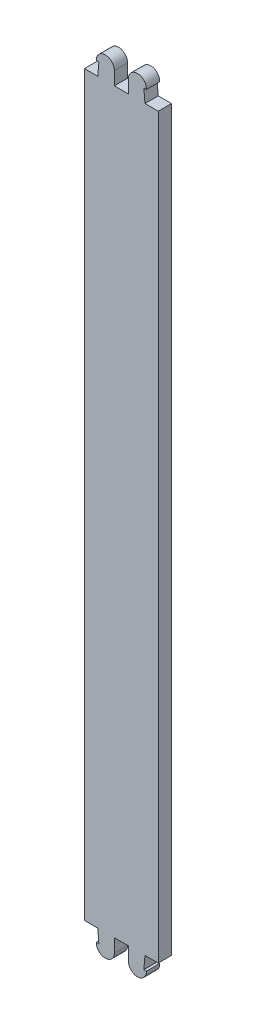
ISO-10303-21;
HEADER;
FILE_DESCRIPTION(('STEP AP214'),'2;1');
FILE_NAME('part.step','',(''),(''),'','','');
FILE_SCHEMA(('AUTOMOTIVE_DESIGN { 1 0 10303 214 1 1 1 1 }'));
ENDSEC;
DATA;
#1=APPLICATION_CONTEXT('core data for automotive mechanical design processes');
#2=APPLICATION_PROTOCOL_DEFINITION('international standard','automotive_design',2000,#1);
#3=PRODUCT_CONTEXT('',#1,'mechanical');
#4=PRODUCT('Part','Part','',(#3));
#5=PRODUCT_RELATED_PRODUCT_CATEGORY('part','',(#4));
#6=PRODUCT_DEFINITION_FORMATION('','',#4);
#7=PRODUCT_DEFINITION_CONTEXT('part definition',#1,'design');
#8=PRODUCT_DEFINITION('design','',#6,#7);
#9=PRODUCT_DEFINITION_SHAPE('','',#8);
#10=(LENGTH_UNIT() NAMED_UNIT(*) SI_UNIT(.MILLI.,.METRE.));
#11=(NAMED_UNIT(*) PLANE_ANGLE_UNIT() SI_UNIT($,.RADIAN.));
#12=(NAMED_UNIT(*) SI_UNIT($,.STERADIAN.) SOLID_ANGLE_UNIT());
#13=UNCERTAINTY_MEASURE_WITH_UNIT(LENGTH_MEASURE(1.E-05),#10,'distance_accuracy_value','');
#14=(GEOMETRIC_REPRESENTATION_CONTEXT(3) GLOBAL_UNCERTAINTY_ASSIGNED_CONTEXT((#13)) GLOBAL_UNIT_ASSIGNED_CONTEXT((#10,
#11,#12)) REPRESENTATION_CONTEXT('',''));
#15=CARTESIAN_POINT('',(0.,0.,0.));
#16=DIRECTION('',(0.,0.,1.));
#17=DIRECTION('',(1.,0.,0.));
#18=AXIS2_PLACEMENT_3D('',#15,#16,#17);
#19=CARTESIAN_POINT('',(3.26487,-115.2,2.7));
#20=DIRECTION('',(0.,0.,-1.));
#21=DIRECTION('',(-1.,0.,0.));
#22=AXIS2_PLACEMENT_3D('',#19,#20,#21);
#23=CYLINDRICAL_SURFACE('',#22,1.83487);
#24=CARTESIAN_POINT('',(3.26487,-115.2,0.));
#25=DIRECTION('',(0.,0.,1.));
#26=DIRECTION('',(1.,0.,0.));
#27=AXIS2_PLACEMENT_3D('',#24,#25,#26);
#28=CIRCLE('',#27,1.83487);
#29=CARTESIAN_POINT('',(5.09840426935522,-115.13,0.));
#30=VERTEX_POINT('',#29);
#31=CARTESIAN_POINT('',(1.43,-115.2,0.));
#32=VERTEX_POINT('',#31);
#33=EDGE_CURVE('E240',#30,#32,#28,.F.);
#34=ORIENTED_EDGE('',*,*,#33,.F.);
#35=DIRECTION('',(0.,0.,-1.));
#36=VECTOR('',#35,1.);
#37=CARTESIAN_POINT('',(5.09840426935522,-115.13,2.7));
#38=LINE('',#37,#36);
#39=CARTESIAN_POINT('',(5.09840426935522,-115.13,2.7));
#40=VERTEX_POINT('',#39);
#41=EDGE_CURVE('E11',#40,#30,#38,.T.);
#42=ORIENTED_EDGE('',*,*,#41,.F.);
#43=CARTESIAN_POINT('',(3.26487,-115.2,2.7));
#44=DIRECTION('',(0.,0.,1.));
#45=DIRECTION('',(1.,0.,0.));
#46=AXIS2_PLACEMENT_3D('',#43,#44,#45);
#47=CIRCLE('',#46,1.83487);
#48=CARTESIAN_POINT('',(1.43,-115.2,2.7));
#49=VERTEX_POINT('',#48);
#50=EDGE_CURVE('E325',#40,#49,#47,.F.);
#51=ORIENTED_EDGE('',*,*,#50,.T.);
#52=DIRECTION('',(0.,0.,-1.));
#53=VECTOR('',#52,1.);
#54=CARTESIAN_POINT('',(1.43,-115.2,2.7));
#55=LINE('',#54,#53);
#56=EDGE_CURVE('E146',#49,#32,#55,.T.);
#57=ORIENTED_EDGE('',*,*,#56,.T.);
#58=EDGE_LOOP('',(#34,#42,#51,#57));
#59=FACE_BOUND('',#58,.T.);
#60=ADVANCED_FACE('F47',(#59),#23,.T.);
#61=CARTESIAN_POINT('',(0.,-115.13,2.7));
#62=DIRECTION('',(0.,1.,0.));
#63=DIRECTION('',(0.,0.,1.));
#64=AXIS2_PLACEMENT_3D('',#61,#62,#63);
#65=PLANE('',#64);
#66=DIRECTION('',(1.,0.,0.));
#67=VECTOR('',#66,1.);
#68=CARTESIAN_POINT('',(0.,-115.13,0.));
#69=LINE('',#68,#67);
#70=CARTESIAN_POINT('',(4.57,-115.13,0.));
#71=VERTEX_POINT('',#70);
#72=EDGE_CURVE('E244',#71,#30,#69,.T.);
#73=ORIENTED_EDGE('',*,*,#72,.F.);
#74=DIRECTION('',(0.,0.,-1.));
#75=VECTOR('',#74,1.);
#76=CARTESIAN_POINT('',(4.57,-115.13,2.7));
#77=LINE('',#76,#75);
#78=CARTESIAN_POINT('',(4.57,-115.13,2.7));
#79=VERTEX_POINT('',#78);
#80=EDGE_CURVE('E56',#79,#71,#77,.T.);
#81=ORIENTED_EDGE('',*,*,#80,.F.);
#82=DIRECTION('',(1.,0.,0.));
#83=VECTOR('',#82,1.);
#84=CARTESIAN_POINT('',(0.,-115.13,2.7));
#85=LINE('',#84,#83);
#86=EDGE_CURVE('E415',#79,#40,#85,.T.);
#87=ORIENTED_EDGE('',*,*,#86,.T.);
#88=ORIENTED_EDGE('',*,*,#41,.T.);
#89=EDGE_LOOP('',(#73,#81,#87,#88));
#90=FACE_BOUND('',#89,.T.);
#91=ADVANCED_FACE('F403',(#90),#65,.T.);
#92=CARTESIAN_POINT('',(14.5313430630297,-1.27132778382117,2.7));
#93=DIRECTION('',(0.996194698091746,-0.0871557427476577,0.));
#94=DIRECTION('',(0.0871557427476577,0.996194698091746,0.));
#95=AXIS2_PLACEMENT_3D('',#92,#93,#94);
#96=PLANE('',#95);
#97=DIRECTION('',(-0.0871557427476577,-0.996194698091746,0.));
#98=VECTOR('',#97,1.);
#99=CARTESIAN_POINT('',(14.5313430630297,-1.27132778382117,0.));
#100=LINE('',#99,#98);
#101=CARTESIAN_POINT('',(4.80009518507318,-112.5,0.));
#102=VERTEX_POINT('',#101);
#103=EDGE_CURVE('E248',#102,#71,#100,.T.);
#104=ORIENTED_EDGE('',*,*,#103,.F.);
#105=DIRECTION('',(0.,0.,-1.));
#106=VECTOR('',#105,1.);
#107=CARTESIAN_POINT('',(4.80009518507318,-112.5,2.7));
#108=LINE('',#107,#106);
#109=CARTESIAN_POINT('',(4.80009518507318,-112.5,2.7));
#110=VERTEX_POINT('',#109);
#111=EDGE_CURVE('E390',#110,#102,#108,.T.);
#112=ORIENTED_EDGE('',*,*,#111,.F.);
#113=DIRECTION('',(-0.0871557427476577,-0.996194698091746,0.));
#114=VECTOR('',#113,1.);
#115=CARTESIAN_POINT('',(14.5313430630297,-1.27132778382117,2.7));
#116=LINE('',#115,#114);
#117=EDGE_CURVE('E399',#110,#79,#116,.T.);
#118=ORIENTED_EDGE('',*,*,#117,.T.);
#119=ORIENTED_EDGE('',*,*,#80,.T.);
#120=EDGE_LOOP('',(#104,#112,#118,#119));
#121=FACE_BOUND('',#120,.T.);
#122=ADVANCED_FACE('F397',(#121),#96,.T.);
#123=CARTESIAN_POINT('',(0.,-112.5,2.7));
#124=DIRECTION('',(0.,-1.,0.));
#125=DIRECTION('',(0.,0.,-1.));
#126=AXIS2_PLACEMENT_3D('',#123,#124,#125);
#127=PLANE('',#126);
#128=DIRECTION('',(-1.,0.,0.));
#129=VECTOR('',#128,1.);
#130=CARTESIAN_POINT('',(0.,-112.5,0.));
#131=LINE('',#130,#129);
#132=CARTESIAN_POINT('',(7.50526,-112.5,0.));
#133=VERTEX_POINT('',#132);
#134=EDGE_CURVE('E252',#133,#102,#131,.T.);
#135=ORIENTED_EDGE('',*,*,#134,.F.);
#136=DIRECTION('',(0.,0.,-1.));
#137=VECTOR('',#136,1.);
#138=CARTESIAN_POINT('',(7.50526,-112.5,2.7));
#139=LINE('',#138,#137);
#140=CARTESIAN_POINT('',(7.50526,-112.5,2.7));
#141=VERTEX_POINT('',#140);
#142=EDGE_CURVE('E387',#141,#133,#139,.T.);
#143=ORIENTED_EDGE('',*,*,#142,.F.);
#144=DIRECTION('',(-1.,0.,0.));
#145=VECTOR('',#144,1.);
#146=CARTESIAN_POINT('',(0.,-112.5,2.7));
#147=LINE('',#146,#145);
#148=EDGE_CURVE('E414',#141,#110,#147,.T.);
#149=ORIENTED_EDGE('',*,*,#148,.T.);
#150=ORIENTED_EDGE('',*,*,#111,.T.);
#151=EDGE_LOOP('',(#135,#143,#149,#150));
#152=FACE_BOUND('',#151,.T.);
#153=ADVANCED_FACE('F410',(#152),#127,.T.);
#154=CARTESIAN_POINT('',(7.50526,0.,2.7));
#155=DIRECTION('',(-1.,0.,0.));
#156=DIRECTION('',(0.,0.,1.));
#157=AXIS2_PLACEMENT_3D('',#154,#155,#156);
#158=PLANE('',#157);
#159=DIRECTION('',(0.,1.,0.));
#160=VECTOR('',#159,1.);
#161=CARTESIAN_POINT('',(7.50526,0.,0.));
#162=LINE('',#161,#160);
#163=CARTESIAN_POINT('',(7.50526,37.5,0.));
#164=VERTEX_POINT('',#163);
#165=EDGE_CURVE('E256',#133,#164,#162,.T.);
#166=ORIENTED_EDGE('',*,*,#165,.T.);
#167=DIRECTION('',(0.,0.,-1.));
#168=VECTOR('',#167,1.);
#169=CARTESIAN_POINT('',(7.50526,37.5,2.7));
#170=LINE('',#169,#168);
#171=CARTESIAN_POINT('',(7.50526,37.5,2.7));
#172=VERTEX_POINT('',#171);
#173=EDGE_CURVE('E383',#172,#164,#170,.T.);
#174=ORIENTED_EDGE('',*,*,#173,.F.);
#175=DIRECTION('',(0.,1.,0.));
#176=VECTOR('',#175,1.);
#177=CARTESIAN_POINT('',(7.50526,0.,2.7));
#178=LINE('',#177,#176);
#179=EDGE_CURVE('E420',#141,#172,#178,.T.);
#180=ORIENTED_EDGE('',*,*,#179,.F.);
#181=ORIENTED_EDGE('',*,*,#142,.T.);
#182=EDGE_LOOP('',(#166,#174,#180,#181));
#183=FACE_BOUND('',#182,.T.);
#184=ADVANCED_FACE('F502',(#183),#158,.F.);
#185=CARTESIAN_POINT('',(0.,37.5,2.7));
#186=DIRECTION('',(0.,-1.,0.));
#187=DIRECTION('',(0.,0.,-1.));
#188=AXIS2_PLACEMENT_3D('',#185,#186,#187);
#189=PLANE('',#188);
#190=DIRECTION('',(-1.,0.,0.));
#191=VECTOR('',#190,1.);
#192=CARTESIAN_POINT('',(0.,37.5,0.));
#193=LINE('',#192,#191);
#194=CARTESIAN_POINT('',(4.80009518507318,37.5,0.));
#195=VERTEX_POINT('',#194);
#196=EDGE_CURVE('E259',#164,#195,#193,.T.);
#197=ORIENTED_EDGE('',*,*,#196,.T.);
#198=DIRECTION('',(0.,0.,-1.));
#199=VECTOR('',#198,1.);
#200=CARTESIAN_POINT('',(4.80009518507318,37.5,2.7));
#201=LINE('',#200,#199);
#202=CARTESIAN_POINT('',(4.80009518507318,37.5,2.7));
#203=VERTEX_POINT('',#202);
#204=EDGE_CURVE('E379',#203,#195,#201,.T.);
#205=ORIENTED_EDGE('',*,*,#204,.F.);
#206=DIRECTION('',(-1.,0.,0.));
#207=VECTOR('',#206,1.);
#208=CARTESIAN_POINT('',(0.,37.5,2.7));
#209=LINE('',#208,#207);
#210=EDGE_CURVE('E427',#172,#203,#209,.T.);
#211=ORIENTED_EDGE('',*,*,#210,.F.);
#212=ORIENTED_EDGE('',*,*,#173,.T.);
#213=EDGE_LOOP('',(#197,#205,#211,#212));
#214=FACE_BOUND('',#213,.T.);
#215=ADVANCED_FACE('F505',(#214),#189,.F.);
#216=CARTESIAN_POINT('',(8.01953640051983,0.701618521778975,2.7));
#217=DIRECTION('',(-0.996194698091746,-0.0871557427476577,0.));
#218=DIRECTION('',(0.0871557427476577,-0.996194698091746,0.));
#219=AXIS2_PLACEMENT_3D('',#216,#217,#218);
#220=PLANE('',#219);
#221=DIRECTION('',(-0.0871557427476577,0.996194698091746,0.));
#222=VECTOR('',#221,1.);
#223=CARTESIAN_POINT('',(8.01953640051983,0.701618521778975,0.));
#224=LINE('',#223,#222);
#225=CARTESIAN_POINT('',(4.57,40.13,0.));
#226=VERTEX_POINT('',#225);
#227=EDGE_CURVE('E262',#195,#226,#224,.T.);
#228=ORIENTED_EDGE('',*,*,#227,.T.);
#229=DIRECTION('',(0.,0.,-1.));
#230=VECTOR('',#229,1.);
#231=CARTESIAN_POINT('',(4.57,40.13,2.7));
#232=LINE('',#231,#230);
#233=CARTESIAN_POINT('',(4.57,40.13,2.7));
#234=VERTEX_POINT('',#233);
#235=EDGE_CURVE('E375',#234,#226,#232,.T.);
#236=ORIENTED_EDGE('',*,*,#235,.F.);
#237=DIRECTION('',(-0.0871557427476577,0.996194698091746,0.));
#238=VECTOR('',#237,1.);
#239=CARTESIAN_POINT('',(8.01953640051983,0.701618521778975,2.7));
#240=LINE('',#239,#238);
#241=EDGE_CURVE('E430',#203,#234,#240,.T.);
#242=ORIENTED_EDGE('',*,*,#241,.F.);
#243=ORIENTED_EDGE('',*,*,#204,.T.);
#244=EDGE_LOOP('',(#228,#236,#242,#243));
#245=FACE_BOUND('',#244,.T.);
#246=ADVANCED_FACE('F509',(#245),#220,.F.);
#247=CARTESIAN_POINT('',(0.,40.13,2.7));
#248=DIRECTION('',(0.,1.,0.));
#249=DIRECTION('',(0.,0.,1.));
#250=AXIS2_PLACEMENT_3D('',#247,#248,#249);
#251=PLANE('',#250);
#252=DIRECTION('',(1.,0.,0.));
#253=VECTOR('',#252,1.);
#254=CARTESIAN_POINT('',(0.,40.13,0.));
#255=LINE('',#254,#253);
#256=CARTESIAN_POINT('',(5.09840426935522,40.13,0.));
#257=VERTEX_POINT('',#256);
#258=EDGE_CURVE('E265',#226,#257,#255,.T.);
#259=ORIENTED_EDGE('',*,*,#258,.T.);
#260=DIRECTION('',(0.,0.,-1.));
#261=VECTOR('',#260,1.);
#262=CARTESIAN_POINT('',(5.09840426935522,40.13,2.7));
#263=LINE('',#262,#261);
#264=CARTESIAN_POINT('',(5.09840426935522,40.13,2.7));
#265=VERTEX_POINT('',#264);
#266=EDGE_CURVE('E371',#265,#257,#263,.T.);
#267=ORIENTED_EDGE('',*,*,#266,.F.);
#268=DIRECTION('',(1.,0.,0.));
#269=VECTOR('',#268,1.);
#270=CARTESIAN_POINT('',(0.,40.13,2.7));
#271=LINE('',#270,#269);
#272=EDGE_CURVE('E433',#234,#265,#271,.T.);
#273=ORIENTED_EDGE('',*,*,#272,.F.);
#274=ORIENTED_EDGE('',*,*,#235,.T.);
#275=EDGE_LOOP('',(#259,#267,#273,#274));
#276=FACE_BOUND('',#275,.T.);
#277=ADVANCED_FACE('F513',(#276),#251,.F.);
#278=CARTESIAN_POINT('',(3.26487,40.2,2.7));
#279=DIRECTION('',(0.,0.,-1.));
#280=DIRECTION('',(-1.,0.,0.));
#281=AXIS2_PLACEMENT_3D('',#278,#279,#280);
#282=CYLINDRICAL_SURFACE('',#281,1.83487);
#283=CARTESIAN_POINT('',(3.26487,40.2,0.));
#284=DIRECTION('',(0.,0.,1.));
#285=DIRECTION('',(1.,0.,0.));
#286=AXIS2_PLACEMENT_3D('',#283,#284,#285);
#287=CIRCLE('',#286,1.83487);
#288=CARTESIAN_POINT('',(1.43,40.2,0.));
#289=VERTEX_POINT('',#288);
#290=EDGE_CURVE('E268',#257,#289,#287,.T.);
#291=ORIENTED_EDGE('',*,*,#290,.T.);
#292=DIRECTION('',(0.,0.,-1.));
#293=VECTOR('',#292,1.);
#294=CARTESIAN_POINT('',(1.43,40.2,2.7));
#295=LINE('',#294,#293);
#296=CARTESIAN_POINT('',(1.43,40.2,2.7));
#297=VERTEX_POINT('',#296);
#298=EDGE_CURVE('E368',#297,#289,#295,.T.);
#299=ORIENTED_EDGE('',*,*,#298,.F.);
#300=CARTESIAN_POINT('',(3.26487,40.2,2.7));
#301=DIRECTION('',(0.,0.,1.));
#302=DIRECTION('',(1.,0.,0.));
#303=AXIS2_PLACEMENT_3D('',#300,#301,#302);
#304=CIRCLE('',#303,1.83487);
#305=EDGE_CURVE('E436',#265,#297,#304,.T.);
#306=ORIENTED_EDGE('',*,*,#305,.F.);
#307=ORIENTED_EDGE('',*,*,#266,.T.);
#308=EDGE_LOOP('',(#291,#299,#306,#307));
#309=FACE_BOUND('',#308,.T.);
#310=ADVANCED_FACE('F517',(#309),#282,.T.);
#311=CARTESIAN_POINT('',(1.42999999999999,0.,2.7));
#312=DIRECTION('',(-1.,0.,0.));
#313=DIRECTION('',(0.,-1.,0.));
#314=AXIS2_PLACEMENT_3D('',#311,#312,#313);
#315=PLANE('',#314);
#316=DIRECTION('',(0.,1.,0.));
#317=VECTOR('',#316,1.);
#318=CARTESIAN_POINT('',(1.42999999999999,0.,0.));
#319=LINE('',#318,#317);
#320=CARTESIAN_POINT('',(1.43,37.5,0.));
#321=VERTEX_POINT('',#320);
#322=EDGE_CURVE('E272',#321,#289,#319,.T.);
#323=ORIENTED_EDGE('',*,*,#322,.F.);
#324=DIRECTION('',(0.,0.,-1.));
#325=VECTOR('',#324,1.);
#326=CARTESIAN_POINT('',(1.43,37.5,2.7));
#327=LINE('',#326,#325);
#328=CARTESIAN_POINT('',(1.43,37.5,2.7));
#329=VERTEX_POINT('',#328);
#330=EDGE_CURVE('E365',#329,#321,#327,.T.);
#331=ORIENTED_EDGE('',*,*,#330,.F.);
#332=DIRECTION('',(0.,1.,0.));
#333=VECTOR('',#332,1.);
#334=CARTESIAN_POINT('',(1.42999999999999,0.,2.7));
#335=LINE('',#334,#333);
#336=EDGE_CURVE('E439',#329,#297,#335,.T.);
#337=ORIENTED_EDGE('',*,*,#336,.T.);
#338=ORIENTED_EDGE('',*,*,#298,.T.);
#339=EDGE_LOOP('',(#323,#331,#337,#338));
#340=FACE_BOUND('',#339,.T.);
#341=ADVANCED_FACE('F521',(#340),#315,.T.);
#342=CARTESIAN_POINT('',(0.,37.5,2.7));
#343=DIRECTION('',(0.,-1.,0.));
#344=DIRECTION('',(0.,0.,-1.));
#345=AXIS2_PLACEMENT_3D('',#342,#343,#344);
#346=PLANE('',#345);
#347=DIRECTION('',(-1.,0.,0.));
#348=VECTOR('',#347,1.);
#349=CARTESIAN_POINT('',(0.,37.5,0.));
#350=LINE('',#349,#348);
#351=CARTESIAN_POINT('',(-1.43,37.5,0.));
#352=VERTEX_POINT('',#351);
#353=EDGE_CURVE('E276',#321,#352,#350,.T.);
#354=ORIENTED_EDGE('',*,*,#353,.T.);
#355=DIRECTION('',(0.,0.,-1.));
#356=VECTOR('',#355,1.);
#357=CARTESIAN_POINT('',(-1.43,37.5,2.7));
#358=LINE('',#357,#356);
#359=CARTESIAN_POINT('',(-1.43,37.5,2.7));
#360=VERTEX_POINT('',#359);
#361=EDGE_CURVE('E361',#360,#352,#358,.T.);
#362=ORIENTED_EDGE('',*,*,#361,.F.);
#363=DIRECTION('',(-1.,0.,0.));
#364=VECTOR('',#363,1.);
#365=CARTESIAN_POINT('',(0.,37.5,2.7));
#366=LINE('',#365,#364);
#367=EDGE_CURVE('E443',#329,#360,#366,.T.);
#368=ORIENTED_EDGE('',*,*,#367,.F.);
#369=ORIENTED_EDGE('',*,*,#330,.T.);
#370=EDGE_LOOP('',(#354,#362,#368,#369));
#371=FACE_BOUND('',#370,.T.);
#372=ADVANCED_FACE('F525',(#371),#346,.F.);
#373=CARTESIAN_POINT('',(-1.42999999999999,0.,2.7));
#374=DIRECTION('',(-1.,0.,0.));
#375=DIRECTION('',(0.,-1.,0.));
#376=AXIS2_PLACEMENT_3D('',#373,#374,#375);
#377=PLANE('',#376);
#378=DIRECTION('',(0.,1.,0.));
#379=VECTOR('',#378,1.);
#380=CARTESIAN_POINT('',(-1.42999999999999,0.,0.));
#381=LINE('',#380,#379);
#382=CARTESIAN_POINT('',(-1.43,40.2,0.));
#383=VERTEX_POINT('',#382);
#384=EDGE_CURVE('E279',#352,#383,#381,.T.);
#385=ORIENTED_EDGE('',*,*,#384,.T.);
#386=DIRECTION('',(0.,0.,-1.));
#387=VECTOR('',#386,1.);
#388=CARTESIAN_POINT('',(-1.43,40.2,2.7));
#389=LINE('',#388,#387);
#390=CARTESIAN_POINT('',(-1.43,40.2,2.7));
#391=VERTEX_POINT('',#390);
#392=EDGE_CURVE('E358',#391,#383,#389,.T.);
#393=ORIENTED_EDGE('',*,*,#392,.F.);
#394=DIRECTION('',(0.,1.,0.));
#395=VECTOR('',#394,1.);
#396=CARTESIAN_POINT('',(-1.42999999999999,0.,2.7));
#397=LINE('',#396,#395);
#398=EDGE_CURVE('E446',#360,#391,#397,.T.);
#399=ORIENTED_EDGE('',*,*,#398,.F.);
#400=ORIENTED_EDGE('',*,*,#361,.T.);
#401=EDGE_LOOP('',(#385,#393,#399,#400));
#402=FACE_BOUND('',#401,.T.);
#403=ADVANCED_FACE('F529',(#402),#377,.F.);
#404=CARTESIAN_POINT('',(-3.26487,40.2,2.7));
#405=DIRECTION('',(0.,0.,-1.));
#406=DIRECTION('',(-1.,0.,0.));
#407=AXIS2_PLACEMENT_3D('',#404,#405,#406);
#408=CYLINDRICAL_SURFACE('',#407,1.83487);
#409=CARTESIAN_POINT('',(-3.26487,40.2,0.));
#410=DIRECTION('',(0.,0.,1.));
#411=DIRECTION('',(1.,0.,0.));
#412=AXIS2_PLACEMENT_3D('',#409,#410,#411);
#413=CIRCLE('',#412,1.83487);
#414=CARTESIAN_POINT('',(-5.09840426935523,40.13,0.));
#415=VERTEX_POINT('',#414);
#416=EDGE_CURVE('E283',#415,#383,#413,.F.);
#417=ORIENTED_EDGE('',*,*,#416,.F.);
#418=DIRECTION('',(0.,0.,-1.));
#419=VECTOR('',#418,1.);
#420=CARTESIAN_POINT('',(-5.09840426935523,40.13,2.7));
#421=LINE('',#420,#419);
#422=CARTESIAN_POINT('',(-5.09840426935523,40.13,2.7));
#423=VERTEX_POINT('',#422);
#424=EDGE_CURVE('E355',#423,#415,#421,.T.);
#425=ORIENTED_EDGE('',*,*,#424,.F.);
#426=CARTESIAN_POINT('',(-3.26487,40.2,2.7));
#427=DIRECTION('',(0.,0.,1.));
#428=DIRECTION('',(1.,0.,0.));
#429=AXIS2_PLACEMENT_3D('',#426,#427,#428);
#430=CIRCLE('',#429,1.83487);
#431=EDGE_CURVE('E449',#423,#391,#430,.F.);
#432=ORIENTED_EDGE('',*,*,#431,.T.);
#433=ORIENTED_EDGE('',*,*,#392,.T.);
#434=EDGE_LOOP('',(#417,#425,#432,#433));
#435=FACE_BOUND('',#434,.T.);
#436=ADVANCED_FACE('F533',(#435),#408,.T.);
#437=CARTESIAN_POINT('',(0.,40.13,2.7));
#438=DIRECTION('',(0.,-1.,0.));
#439=DIRECTION('',(0.,0.,-1.));
#440=AXIS2_PLACEMENT_3D('',#437,#438,#439);
#441=PLANE('',#440);
#442=DIRECTION('',(-1.,0.,0.));
#443=VECTOR('',#442,1.);
#444=CARTESIAN_POINT('',(0.,40.13,0.));
#445=LINE('',#444,#443);
#446=CARTESIAN_POINT('',(-4.57,40.13,0.));
#447=VERTEX_POINT('',#446);
#448=EDGE_CURVE('E287',#447,#415,#445,.T.);
#449=ORIENTED_EDGE('',*,*,#448,.F.);
#450=DIRECTION('',(0.,0.,-1.));
#451=VECTOR('',#450,1.);
#452=CARTESIAN_POINT('',(-4.57,40.13,2.7));
#453=LINE('',#452,#451);
#454=CARTESIAN_POINT('',(-4.57,40.13,2.7));
#455=VERTEX_POINT('',#454);
#456=EDGE_CURVE('E352',#455,#447,#453,.T.);
#457=ORIENTED_EDGE('',*,*,#456,.F.);
#458=DIRECTION('',(-1.,0.,0.));
#459=VECTOR('',#458,1.);
#460=CARTESIAN_POINT('',(0.,40.13,2.7));
#461=LINE('',#460,#459);
#462=EDGE_CURVE('E453',#455,#423,#461,.T.);
#463=ORIENTED_EDGE('',*,*,#462,.T.);
#464=ORIENTED_EDGE('',*,*,#424,.T.);
#465=EDGE_LOOP('',(#449,#457,#463,#464));
#466=FACE_BOUND('',#465,.T.);
#467=ADVANCED_FACE('F537',(#466),#441,.T.);
#468=CARTESIAN_POINT('',(-8.0195364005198,0.701618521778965,2.7));
#469=DIRECTION('',(-0.996194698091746,0.0871557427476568,0.));
#470=DIRECTION('',(-0.0871557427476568,-0.996194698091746,0.));
#471=AXIS2_PLACEMENT_3D('',#468,#469,#470);
#472=PLANE('',#471);
#473=DIRECTION('',(0.0871557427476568,0.996194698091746,0.));
#474=VECTOR('',#473,1.);
#475=CARTESIAN_POINT('',(-8.0195364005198,0.701618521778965,0.));
#476=LINE('',#475,#474);
#477=CARTESIAN_POINT('',(-4.80009518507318,37.5,0.));
#478=VERTEX_POINT('',#477);
#479=EDGE_CURVE('E291',#478,#447,#476,.T.);
#480=ORIENTED_EDGE('',*,*,#479,.F.);
#481=DIRECTION('',(0.,0.,-1.));
#482=VECTOR('',#481,1.);
#483=CARTESIAN_POINT('',(-4.80009518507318,37.5,2.7));
#484=LINE('',#483,#482);
#485=CARTESIAN_POINT('',(-4.80009518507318,37.5,2.7));
#486=VERTEX_POINT('',#485);
#487=EDGE_CURVE('E349',#486,#478,#484,.T.);
#488=ORIENTED_EDGE('',*,*,#487,.F.);
#489=DIRECTION('',(0.0871557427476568,0.996194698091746,0.));
#490=VECTOR('',#489,1.);
#491=CARTESIAN_POINT('',(-8.0195364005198,0.701618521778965,2.7));
#492=LINE('',#491,#490);
#493=EDGE_CURVE('E457',#486,#455,#492,.T.);
#494=ORIENTED_EDGE('',*,*,#493,.T.);
#495=ORIENTED_EDGE('',*,*,#456,.T.);
#496=EDGE_LOOP('',(#480,#488,#494,#495));
#497=FACE_BOUND('',#496,.T.);
#498=ADVANCED_FACE('F541',(#497),#472,.T.);
#499=CARTESIAN_POINT('',(4.80947630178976E-13,37.4999999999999,2.7));
#500=DIRECTION('',(0.,-1.,0.));
#501=DIRECTION('',(1.,0.,0.));
#502=AXIS2_PLACEMENT_3D('',#499,#500,#501);
#503=PLANE('',#502);
#504=DIRECTION('',(-1.,0.,0.));
#505=VECTOR('',#504,1.);
#506=CARTESIAN_POINT('',(4.80947630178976E-13,37.4999999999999,0.));
#507=LINE('',#506,#505);
#508=CARTESIAN_POINT('',(-7.50526,37.5,0.));
#509=VERTEX_POINT('',#508);
#510=EDGE_CURVE('E295',#478,#509,#507,.T.);
#511=ORIENTED_EDGE('',*,*,#510,.T.);
#512=DIRECTION('',(0.,0.,-1.));
#513=VECTOR('',#512,1.);
#514=CARTESIAN_POINT('',(-7.50526,37.5,2.7));
#515=LINE('',#514,#513);
#516=CARTESIAN_POINT('',(-7.50526,37.5,2.7));
#517=VERTEX_POINT('',#516);
#518=EDGE_CURVE('E346',#517,#509,#515,.T.);
#519=ORIENTED_EDGE('',*,*,#518,.F.);
#520=DIRECTION('',(-1.,0.,0.));
#521=VECTOR('',#520,1.);
#522=CARTESIAN_POINT('',(4.80947630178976E-13,37.4999999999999,2.7));
#523=LINE('',#522,#521);
#524=EDGE_CURVE('E461',#486,#517,#523,.T.);
#525=ORIENTED_EDGE('',*,*,#524,.F.);
#526=ORIENTED_EDGE('',*,*,#487,.T.);
#527=EDGE_LOOP('',(#511,#519,#525,#526));
#528=FACE_BOUND('',#527,.T.);
#529=ADVANCED_FACE('F545',(#528),#503,.F.);
#530=CARTESIAN_POINT('',(-7.50526,0.,2.7));
#531=DIRECTION('',(-1.,0.,0.));
#532=DIRECTION('',(0.,0.,1.));
#533=AXIS2_PLACEMENT_3D('',#530,#531,#532);
#534=PLANE('',#533);
#535=DIRECTION('',(0.,1.,0.));
#536=VECTOR('',#535,1.);
#537=CARTESIAN_POINT('',(-7.50526,0.,0.));
#538=LINE('',#537,#536);
#539=CARTESIAN_POINT('',(-7.50526,-112.5,0.));
#540=VERTEX_POINT('',#539);
#541=EDGE_CURVE('E299',#540,#509,#538,.T.);
#542=ORIENTED_EDGE('',*,*,#541,.F.);
#543=DIRECTION('',(0.,0.,-1.));
#544=VECTOR('',#543,1.);
#545=CARTESIAN_POINT('',(-7.50526,-112.5,2.7));
#546=LINE('',#545,#544);
#547=CARTESIAN_POINT('',(-7.50526,-112.5,2.7));
#548=VERTEX_POINT('',#547);
#549=EDGE_CURVE('E343',#548,#540,#546,.T.);
#550=ORIENTED_EDGE('',*,*,#549,.F.);
#551=DIRECTION('',(0.,1.,0.));
#552=VECTOR('',#551,1.);
#553=CARTESIAN_POINT('',(-7.50526,0.,2.7));
#554=LINE('',#553,#552);
#555=EDGE_CURVE('E464',#548,#517,#554,.T.);
#556=ORIENTED_EDGE('',*,*,#555,.T.);
#557=ORIENTED_EDGE('',*,*,#518,.T.);
#558=EDGE_LOOP('',(#542,#550,#556,#557));
#559=FACE_BOUND('',#558,.T.);
#560=ADVANCED_FACE('F549',(#559),#534,.T.);
#561=CARTESIAN_POINT('',(1.73141146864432E-12,-112.5,2.7));
#562=DIRECTION('',(0.,-1.,0.));
#563=DIRECTION('',(1.,0.,0.));
#564=AXIS2_PLACEMENT_3D('',#561,#562,#563);
#565=PLANE('',#564);
#566=DIRECTION('',(-1.,0.,0.));
#567=VECTOR('',#566,1.);
#568=CARTESIAN_POINT('',(1.73141146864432E-12,-112.5,0.));
#569=LINE('',#568,#567);
#570=CARTESIAN_POINT('',(-4.80009518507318,-112.5,0.));
#571=VERTEX_POINT('',#570);
#572=EDGE_CURVE('E303',#571,#540,#569,.T.);
#573=ORIENTED_EDGE('',*,*,#572,.F.);
#574=DIRECTION('',(0.,0.,-1.));
#575=VECTOR('',#574,1.);
#576=CARTESIAN_POINT('',(-4.80009518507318,-112.5,2.7));
#577=LINE('',#576,#575);
#578=CARTESIAN_POINT('',(-4.80009518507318,-112.5,2.7));
#579=VERTEX_POINT('',#578);
#580=EDGE_CURVE('E340',#579,#571,#577,.T.);
#581=ORIENTED_EDGE('',*,*,#580,.F.);
#582=DIRECTION('',(-1.,0.,0.));
#583=VECTOR('',#582,1.);
#584=CARTESIAN_POINT('',(1.73141146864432E-12,-112.5,2.7));
#585=LINE('',#584,#583);
#586=EDGE_CURVE('E468',#579,#548,#585,.T.);
#587=ORIENTED_EDGE('',*,*,#586,.T.);
#588=ORIENTED_EDGE('',*,*,#549,.T.);
#589=EDGE_LOOP('',(#573,#581,#587,#588));
#590=FACE_BOUND('',#589,.T.);
#591=ADVANCED_FACE('F553',(#590),#565,.T.);
#592=CARTESIAN_POINT('',(-14.5313430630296,-1.27132778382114,2.7));
#593=DIRECTION('',(0.996194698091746,0.0871557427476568,0.));
#594=DIRECTION('',(-0.0871557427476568,0.996194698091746,0.));
#595=AXIS2_PLACEMENT_3D('',#592,#593,#594);
#596=PLANE('',#595);
#597=DIRECTION('',(0.0871557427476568,-0.996194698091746,0.));
#598=VECTOR('',#597,1.);
#599=CARTESIAN_POINT('',(-14.5313430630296,-1.27132778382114,0.));
#600=LINE('',#599,#598);
#601=CARTESIAN_POINT('',(-4.57,-115.13,0.));
#602=VERTEX_POINT('',#601);
#603=EDGE_CURVE('E307',#571,#602,#600,.T.);
#604=ORIENTED_EDGE('',*,*,#603,.T.);
#605=DIRECTION('',(0.,0.,-1.));
#606=VECTOR('',#605,1.);
#607=CARTESIAN_POINT('',(-4.57,-115.13,2.7));
#608=LINE('',#607,#606);
#609=CARTESIAN_POINT('',(-4.57,-115.13,2.7));
#610=VERTEX_POINT('',#609);
#611=EDGE_CURVE('E336',#610,#602,#608,.T.);
#612=ORIENTED_EDGE('',*,*,#611,.F.);
#613=DIRECTION('',(0.0871557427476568,-0.996194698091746,0.));
#614=VECTOR('',#613,1.);
#615=CARTESIAN_POINT('',(-14.5313430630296,-1.27132778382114,2.7));
#616=LINE('',#615,#614);
#617=EDGE_CURVE('E472',#579,#610,#616,.T.);
#618=ORIENTED_EDGE('',*,*,#617,.F.);
#619=ORIENTED_EDGE('',*,*,#580,.T.);
#620=EDGE_LOOP('',(#604,#612,#618,#619));
#621=FACE_BOUND('',#620,.T.);
#622=ADVANCED_FACE('F557',(#621),#596,.F.);
#623=CARTESIAN_POINT('',(0.,-115.13,2.7));
#624=DIRECTION('',(0.,-1.,0.));
#625=DIRECTION('',(0.,0.,-1.));
#626=AXIS2_PLACEMENT_3D('',#623,#624,#625);
#627=PLANE('',#626);
#628=DIRECTION('',(-1.,0.,0.));
#629=VECTOR('',#628,1.);
#630=CARTESIAN_POINT('',(0.,-115.13,0.));
#631=LINE('',#630,#629);
#632=CARTESIAN_POINT('',(-5.09840426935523,-115.13,0.));
#633=VERTEX_POINT('',#632);
#634=EDGE_CURVE('E310',#602,#633,#631,.T.);
#635=ORIENTED_EDGE('',*,*,#634,.T.);
#636=DIRECTION('',(0.,0.,-1.));
#637=VECTOR('',#636,1.);
#638=CARTESIAN_POINT('',(-5.09840426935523,-115.13,2.7));
#639=LINE('',#638,#637);
#640=CARTESIAN_POINT('',(-5.09840426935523,-115.13,2.7));
#641=VERTEX_POINT('',#640);
#642=EDGE_CURVE('E332',#641,#633,#639,.T.);
#643=ORIENTED_EDGE('',*,*,#642,.F.);
#644=DIRECTION('',(-1.,0.,0.));
#645=VECTOR('',#644,1.);
#646=CARTESIAN_POINT('',(0.,-115.13,2.7));
#647=LINE('',#646,#645);
#648=EDGE_CURVE('E475',#610,#641,#647,.T.);
#649=ORIENTED_EDGE('',*,*,#648,.F.);
#650=ORIENTED_EDGE('',*,*,#611,.T.);
#651=EDGE_LOOP('',(#635,#643,#649,#650));
#652=FACE_BOUND('',#651,.T.);
#653=ADVANCED_FACE('F484',(#652),#627,.F.);
#654=CARTESIAN_POINT('',(-3.26487,-115.2,2.7));
#655=DIRECTION('',(0.,0.,-1.));
#656=DIRECTION('',(-1.,0.,0.));
#657=AXIS2_PLACEMENT_3D('',#654,#655,#656);
#658=CYLINDRICAL_SURFACE('',#657,1.83487);
#659=CARTESIAN_POINT('',(-3.26487,-115.2,0.));
#660=DIRECTION('',(0.,0.,1.));
#661=DIRECTION('',(1.,0.,0.));
#662=AXIS2_PLACEMENT_3D('',#659,#660,#661);
#663=CIRCLE('',#662,1.83487);
#664=CARTESIAN_POINT('',(-1.43,-115.2,0.));
#665=VERTEX_POINT('',#664);
#666=EDGE_CURVE('E313',#633,#665,#663,.T.);
#667=ORIENTED_EDGE('',*,*,#666,.T.);
#668=DIRECTION('',(0.,0.,-1.));
#669=VECTOR('',#668,1.);
#670=CARTESIAN_POINT('',(-1.43,-115.2,2.7));
#671=LINE('',#670,#669);
#672=CARTESIAN_POINT('',(-1.43,-115.2,2.7));
#673=VERTEX_POINT('',#672);
#674=EDGE_CURVE('E224',#673,#665,#671,.T.);
#675=ORIENTED_EDGE('',*,*,#674,.F.);
#676=CARTESIAN_POINT('',(-3.26487,-115.2,2.7));
#677=DIRECTION('',(0.,0.,1.));
#678=DIRECTION('',(1.,0.,0.));
#679=AXIS2_PLACEMENT_3D('',#676,#677,#678);
#680=CIRCLE('',#679,1.83487);
#681=EDGE_CURVE('E229',#641,#673,#680,.T.);
#682=ORIENTED_EDGE('',*,*,#681,.F.);
#683=ORIENTED_EDGE('',*,*,#642,.T.);
#684=EDGE_LOOP('',(#667,#675,#682,#683));
#685=FACE_BOUND('',#684,.T.);
#686=ADVANCED_FACE('F488',(#685),#658,.T.);
#687=CARTESIAN_POINT('',(-1.42999999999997,0.,2.7));
#688=DIRECTION('',(1.,0.,0.));
#689=DIRECTION('',(0.,1.,0.));
#690=AXIS2_PLACEMENT_3D('',#687,#688,#689);
#691=PLANE('',#690);
#692=DIRECTION('',(0.,-1.,0.));
#693=VECTOR('',#692,1.);
#694=CARTESIAN_POINT('',(-1.42999999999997,0.,0.));
#695=LINE('',#694,#693);
#696=CARTESIAN_POINT('',(-1.43,-112.5,0.));
#697=VERTEX_POINT('',#696);
#698=EDGE_CURVE('E218',#697,#665,#695,.T.);
#699=ORIENTED_EDGE('',*,*,#698,.F.);
#700=DIRECTION('',(0.,0.,-1.));
#701=VECTOR('',#700,1.);
#702=CARTESIAN_POINT('',(-1.43,-112.5,2.7));
#703=LINE('',#702,#701);
#704=CARTESIAN_POINT('',(-1.43,-112.5,2.7));
#705=VERTEX_POINT('',#704);
#706=EDGE_CURVE('E213',#705,#697,#703,.T.);
#707=ORIENTED_EDGE('',*,*,#706,.F.);
#708=DIRECTION('',(0.,-1.,0.));
#709=VECTOR('',#708,1.);
#710=CARTESIAN_POINT('',(-1.42999999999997,0.,2.7));
#711=LINE('',#710,#709);
#712=EDGE_CURVE('E216',#705,#673,#711,.T.);
#713=ORIENTED_EDGE('',*,*,#712,.T.);
#714=ORIENTED_EDGE('',*,*,#674,.T.);
#715=EDGE_LOOP('',(#699,#707,#713,#714));
#716=FACE_BOUND('',#715,.T.);
#717=ADVANCED_FACE('F215',(#716),#691,.T.);
#718=CARTESIAN_POINT('',(0.,-112.5,2.7));
#719=DIRECTION('',(0.,-1.,0.));
#720=DIRECTION('',(0.,0.,-1.));
#721=AXIS2_PLACEMENT_3D('',#718,#719,#720);
#722=PLANE('',#721);
#723=DIRECTION('',(-1.,0.,0.));
#724=VECTOR('',#723,1.);
#725=CARTESIAN_POINT('',(0.,-112.5,0.));
#726=LINE('',#725,#724);
#727=CARTESIAN_POINT('',(1.43,-112.5,0.));
#728=VERTEX_POINT('',#727);
#729=EDGE_CURVE('E319',#728,#697,#726,.T.);
#730=ORIENTED_EDGE('',*,*,#729,.F.);
#731=DIRECTION('',(0.,0.,-1.));
#732=VECTOR('',#731,1.);
#733=CARTESIAN_POINT('',(1.43,-112.5,2.7));
#734=LINE('',#733,#732);
#735=CARTESIAN_POINT('',(1.43,-112.5,2.7));
#736=VERTEX_POINT('',#735);
#737=EDGE_CURVE('E139',#736,#728,#734,.T.);
#738=ORIENTED_EDGE('',*,*,#737,.F.);
#739=DIRECTION('',(-1.,0.,0.));
#740=VECTOR('',#739,1.);
#741=CARTESIAN_POINT('',(0.,-112.5,2.7));
#742=LINE('',#741,#740);
#743=EDGE_CURVE('E227',#736,#705,#742,.T.);
#744=ORIENTED_EDGE('',*,*,#743,.T.);
#745=ORIENTED_EDGE('',*,*,#706,.T.);
#746=EDGE_LOOP('',(#730,#738,#744,#745));
#747=FACE_BOUND('',#746,.T.);
#748=ADVANCED_FACE('F233',(#747),#722,.T.);
#749=CARTESIAN_POINT('',(1.42999999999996,0.,2.7));
#750=DIRECTION('',(1.,0.,0.));
#751=DIRECTION('',(0.,1.,0.));
#752=AXIS2_PLACEMENT_3D('',#749,#750,#751);
#753=PLANE('',#752);
#754=DIRECTION('',(0.,-1.,0.));
#755=VECTOR('',#754,1.);
#756=CARTESIAN_POINT('',(1.42999999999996,0.,0.));
#757=LINE('',#756,#755);
#758=EDGE_CURVE('E322',#728,#32,#757,.T.);
#759=ORIENTED_EDGE('',*,*,#758,.T.);
#760=ORIENTED_EDGE('',*,*,#56,.F.);
#761=DIRECTION('',(0.,-1.,0.));
#762=VECTOR('',#761,1.);
#763=CARTESIAN_POINT('',(1.42999999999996,0.,2.7));
#764=LINE('',#763,#762);
#765=EDGE_CURVE('E64',#736,#49,#764,.T.);
#766=ORIENTED_EDGE('',*,*,#765,.F.);
#767=ORIENTED_EDGE('',*,*,#737,.T.);
#768=EDGE_LOOP('',(#759,#760,#766,#767));
#769=FACE_BOUND('',#768,.T.);
#770=ADVANCED_FACE('F489',(#769),#753,.F.);
#771=CARTESIAN_POINT('',(0.,0.,2.7));
#772=DIRECTION('',(0.,0.,1.));
#773=DIRECTION('',(1.,0.,0.));
#774=AXIS2_PLACEMENT_3D('',#771,#772,#773);
#775=PLANE('',#774);
#776=ORIENTED_EDGE('',*,*,#50,.F.);
#777=ORIENTED_EDGE('',*,*,#86,.F.);
#778=ORIENTED_EDGE('',*,*,#117,.F.);
#779=ORIENTED_EDGE('',*,*,#148,.F.);
#780=ORIENTED_EDGE('',*,*,#179,.T.);
#781=ORIENTED_EDGE('',*,*,#210,.T.);
#782=ORIENTED_EDGE('',*,*,#241,.T.);
#783=ORIENTED_EDGE('',*,*,#272,.T.);
#784=ORIENTED_EDGE('',*,*,#305,.T.);
#785=ORIENTED_EDGE('',*,*,#336,.F.);
#786=ORIENTED_EDGE('',*,*,#367,.T.);
#787=ORIENTED_EDGE('',*,*,#398,.T.);
#788=ORIENTED_EDGE('',*,*,#431,.F.);
#789=ORIENTED_EDGE('',*,*,#462,.F.);
#790=ORIENTED_EDGE('',*,*,#493,.F.);
#791=ORIENTED_EDGE('',*,*,#524,.T.);
#792=ORIENTED_EDGE('',*,*,#555,.F.);
#793=ORIENTED_EDGE('',*,*,#586,.F.);
#794=ORIENTED_EDGE('',*,*,#617,.T.);
#795=ORIENTED_EDGE('',*,*,#648,.T.);
#796=ORIENTED_EDGE('',*,*,#681,.T.);
#797=ORIENTED_EDGE('',*,*,#712,.F.);
#798=ORIENTED_EDGE('',*,*,#743,.F.);
#799=ORIENTED_EDGE('',*,*,#765,.T.);
#800=EDGE_LOOP('',(#776,#777,#778,#779,#780,#781,#782,#783,#784,#785,#786,#787,#788,#789,#790,
#791,#792,#793,#794,#795,#796,#797,#798,#799));
#801=FACE_BOUND('',#800,.T.);
#802=ADVANCED_FACE('F226',(#801),#775,.T.);
#803=CARTESIAN_POINT('',(0.,0.,0.));
#804=DIRECTION('',(0.,0.,1.));
#805=DIRECTION('',(1.,0.,0.));
#806=AXIS2_PLACEMENT_3D('',#803,#804,#805);
#807=PLANE('',#806);
#808=ORIENTED_EDGE('',*,*,#33,.T.);
#809=ORIENTED_EDGE('',*,*,#758,.F.);
#810=ORIENTED_EDGE('',*,*,#729,.T.);
#811=ORIENTED_EDGE('',*,*,#698,.T.);
#812=ORIENTED_EDGE('',*,*,#666,.F.);
#813=ORIENTED_EDGE('',*,*,#634,.F.);
#814=ORIENTED_EDGE('',*,*,#603,.F.);
#815=ORIENTED_EDGE('',*,*,#572,.T.);
#816=ORIENTED_EDGE('',*,*,#541,.T.);
#817=ORIENTED_EDGE('',*,*,#510,.F.);
#818=ORIENTED_EDGE('',*,*,#479,.T.);
#819=ORIENTED_EDGE('',*,*,#448,.T.);
#820=ORIENTED_EDGE('',*,*,#416,.T.);
#821=ORIENTED_EDGE('',*,*,#384,.F.);
#822=ORIENTED_EDGE('',*,*,#353,.F.);
#823=ORIENTED_EDGE('',*,*,#322,.T.);
#824=ORIENTED_EDGE('',*,*,#290,.F.);
#825=ORIENTED_EDGE('',*,*,#258,.F.);
#826=ORIENTED_EDGE('',*,*,#227,.F.);
#827=ORIENTED_EDGE('',*,*,#196,.F.);
#828=ORIENTED_EDGE('',*,*,#165,.F.);
#829=ORIENTED_EDGE('',*,*,#134,.T.);
#830=ORIENTED_EDGE('',*,*,#103,.T.);
#831=ORIENTED_EDGE('',*,*,#72,.T.);
#832=EDGE_LOOP('',(#808,#809,#810,#811,#812,#813,#814,#815,#816,#817,#818,#819,#820,#821,#822,
#823,#824,#825,#826,#827,#828,#829,#830,#831));
#833=FACE_BOUND('',#832,.T.);
#834=ADVANCED_FACE('F405',(#833),#807,.F.);
#835=CLOSED_SHELL('',(#60,#91,#122,#153,#184,#215,#246,#277,#310,#341,#372,#403,#436,#467,#498,
#529,#560,#591,#622,#653,#686,#717,#748,#770,#802,#834));
#836=MANIFOLD_SOLID_BREP('B2',#835);
#837=ADVANCED_BREP_SHAPE_REPRESENTATION('',(#18,#836),#14);
#838=SHAPE_DEFINITION_REPRESENTATION(#9,#837);
ENDSEC;
END-ISO-10303-21;
